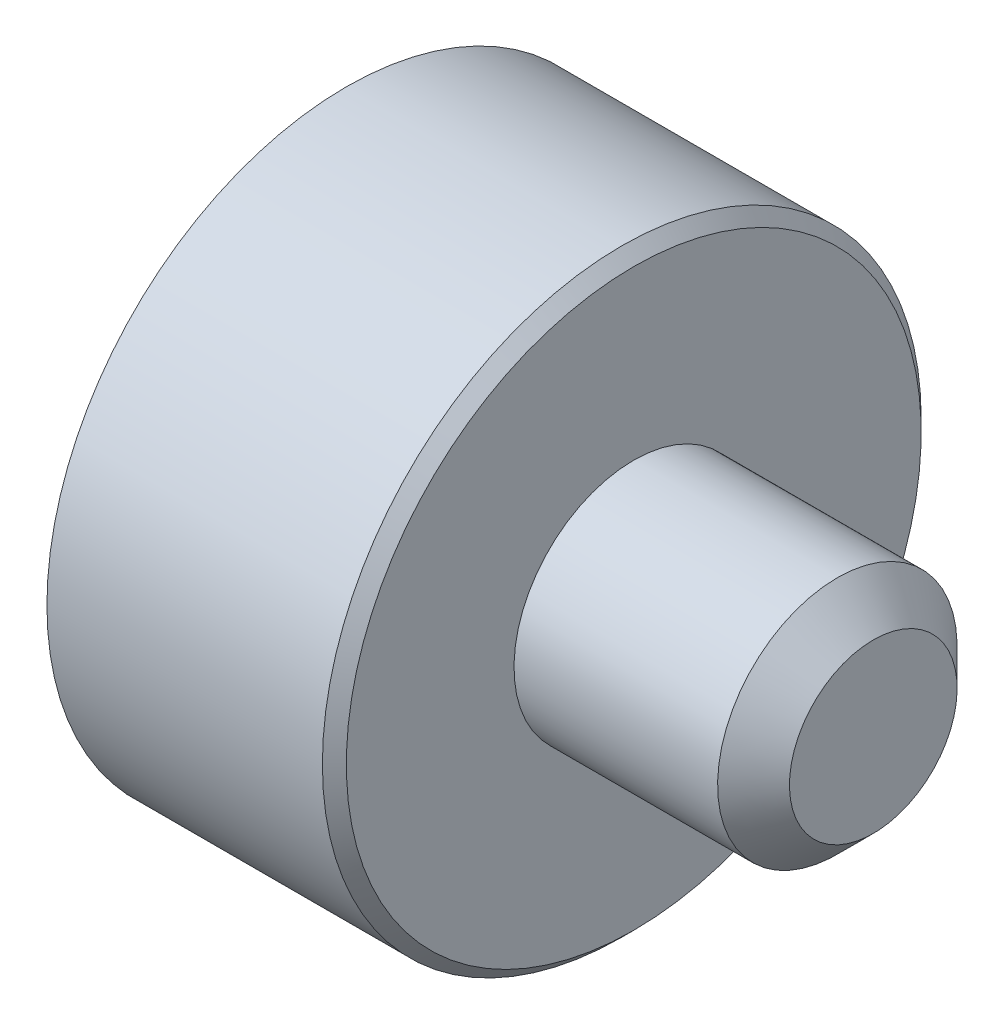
ISO-10303-21;
HEADER;
FILE_DESCRIPTION(('STEP AP214'),'2;1');
FILE_NAME('part.step','',(''),(''),'','','');
FILE_SCHEMA(('AUTOMOTIVE_DESIGN { 1 0 10303 214 1 1 1 1 }'));
ENDSEC;
DATA;
#1=APPLICATION_CONTEXT('core data for automotive mechanical design processes');
#2=APPLICATION_PROTOCOL_DEFINITION('international standard','automotive_design',2000,#1);
#3=PRODUCT_CONTEXT('',#1,'mechanical');
#4=PRODUCT('Part','Part','',(#3));
#5=PRODUCT_RELATED_PRODUCT_CATEGORY('part','',(#4));
#6=PRODUCT_DEFINITION_FORMATION('','',#4);
#7=PRODUCT_DEFINITION_CONTEXT('part definition',#1,'design');
#8=PRODUCT_DEFINITION('design','',#6,#7);
#9=PRODUCT_DEFINITION_SHAPE('','',#8);
#10=(LENGTH_UNIT() NAMED_UNIT(*) SI_UNIT(.MILLI.,.METRE.));
#11=(NAMED_UNIT(*) PLANE_ANGLE_UNIT() SI_UNIT($,.RADIAN.));
#12=(NAMED_UNIT(*) SI_UNIT($,.STERADIAN.) SOLID_ANGLE_UNIT());
#13=UNCERTAINTY_MEASURE_WITH_UNIT(LENGTH_MEASURE(1.E-05),#10,'distance_accuracy_value','');
#14=(GEOMETRIC_REPRESENTATION_CONTEXT(3) GLOBAL_UNCERTAINTY_ASSIGNED_CONTEXT((#13)) GLOBAL_UNIT_ASSIGNED_CONTEXT((#10,
#11,#12)) REPRESENTATION_CONTEXT('',''));
#15=CARTESIAN_POINT('',(0.,0.,0.));
#16=DIRECTION('',(0.,0.,1.));
#17=DIRECTION('',(1.,0.,0.));
#18=AXIS2_PLACEMENT_3D('',#15,#16,#17);
#19=CARTESIAN_POINT('',(0.,0.,0.));
#20=DIRECTION('',(-1.,0.,0.));
#21=DIRECTION('',(0.,-1.,0.));
#22=AXIS2_PLACEMENT_3D('',#19,#20,#21);
#23=PLANE('',#22);
#24=CARTESIAN_POINT('',(0.,0.,0.));
#25=DIRECTION('',(1.,0.,0.));
#26=DIRECTION('',(0.,1.,0.));
#27=AXIS2_PLACEMENT_3D('',#24,#25,#26);
#28=CIRCLE('',#27,5.);
#29=CARTESIAN_POINT('',(0.,5.,0.));
#30=VERTEX_POINT('',#29);
#31=EDGE_CURVE('E10',#30,#30,#28,.T.);
#32=ORIENTED_EDGE('',*,*,#31,.F.);
#33=EDGE_LOOP('',(#32));
#34=FACE_BOUND('',#33,.T.);
#35=ADVANCED_FACE('F29',(#34),#23,.T.);
#36=CARTESIAN_POINT('',(27.,0.,0.));
#37=DIRECTION('',(1.,0.,0.));
#38=DIRECTION('',(0.,1.,0.));
#39=AXIS2_PLACEMENT_3D('',#36,#37,#38);
#40=CYLINDRICAL_SURFACE('',#39,5.);
#41=ORIENTED_EDGE('',*,*,#31,.T.);
#42=EDGE_LOOP('',(#41));
#43=FACE_BOUND('',#42,.T.);
#44=CARTESIAN_POINT('',(5.,0.,0.));
#45=DIRECTION('',(1.,0.,0.));
#46=DIRECTION('',(0.,1.,0.));
#47=AXIS2_PLACEMENT_3D('',#44,#45,#46);
#48=CIRCLE('',#47,5.);
#49=CARTESIAN_POINT('',(5.,5.,0.));
#50=VERTEX_POINT('',#49);
#51=EDGE_CURVE('E35',#50,#50,#48,.T.);
#52=ORIENTED_EDGE('',*,*,#51,.F.);
#53=EDGE_LOOP('',(#52));
#54=FACE_BOUND('',#53,.T.);
#55=ADVANCED_FACE('F77',(#43,#54),#40,.T.);
#56=CARTESIAN_POINT('',(5.,5.,0.));
#57=DIRECTION('',(-1.,0.,0.));
#58=DIRECTION('',(0.,-1.,0.));
#59=AXIS2_PLACEMENT_3D('',#56,#57,#58);
#60=PLANE('',#59);
#61=ORIENTED_EDGE('',*,*,#51,.T.);
#62=EDGE_LOOP('',(#61));
#63=FACE_BOUND('',#62,.T.);
#64=CARTESIAN_POINT('',(5.,0.,0.));
#65=DIRECTION('',(1.,0.,0.));
#66=DIRECTION('',(0.,1.,0.));
#67=AXIS2_PLACEMENT_3D('',#64,#65,#66);
#68=CIRCLE('',#67,12.5);
#69=CARTESIAN_POINT('',(5.,12.5,0.));
#70=VERTEX_POINT('',#69);
#71=EDGE_CURVE('E39',#70,#70,#68,.T.);
#72=ORIENTED_EDGE('',*,*,#71,.F.);
#73=EDGE_LOOP('',(#72));
#74=FACE_BOUND('',#73,.T.);
#75=ADVANCED_FACE('F82',(#63,#74),#60,.T.);
#76=CARTESIAN_POINT('',(27.,0.,0.));
#77=DIRECTION('',(1.,0.,0.));
#78=DIRECTION('',(0.,1.,0.));
#79=AXIS2_PLACEMENT_3D('',#76,#77,#78);
#80=CYLINDRICAL_SURFACE('',#79,12.5);
#81=ORIENTED_EDGE('',*,*,#71,.T.);
#82=EDGE_LOOP('',(#81));
#83=FACE_BOUND('',#82,.T.);
#84=CARTESIAN_POINT('',(16.5,0.,0.));
#85=DIRECTION('',(1.,0.,0.));
#86=DIRECTION('',(0.,1.,0.));
#87=AXIS2_PLACEMENT_3D('',#84,#85,#86);
#88=CIRCLE('',#87,12.5);
#89=CARTESIAN_POINT('',(16.5,12.5,0.));
#90=VERTEX_POINT('',#89);
#91=EDGE_CURVE('E43',#90,#90,#88,.T.);
#92=ORIENTED_EDGE('',*,*,#91,.F.);
#93=EDGE_LOOP('',(#92));
#94=FACE_BOUND('',#93,.T.);
#95=ADVANCED_FACE('F86',(#83,#94),#80,.T.);
#96=CARTESIAN_POINT('',(17.,0.,0.));
#97=DIRECTION('',(-1.,0.,0.));
#98=DIRECTION('',(0.,-1.,0.));
#99=AXIS2_PLACEMENT_3D('',#96,#97,#98);
#100=CONICAL_SURFACE('',#99,12.,0.785398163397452);
#101=ORIENTED_EDGE('',*,*,#91,.T.);
#102=EDGE_LOOP('',(#101));
#103=FACE_BOUND('',#102,.T.);
#104=CARTESIAN_POINT('',(17.,0.,0.));
#105=DIRECTION('',(1.,0.,0.));
#106=DIRECTION('',(0.,1.,0.));
#107=AXIS2_PLACEMENT_3D('',#104,#105,#106);
#108=CIRCLE('',#107,12.);
#109=CARTESIAN_POINT('',(17.,12.,0.));
#110=VERTEX_POINT('',#109);
#111=EDGE_CURVE('E48',#110,#110,#108,.T.);
#112=ORIENTED_EDGE('',*,*,#111,.F.);
#113=EDGE_LOOP('',(#112));
#114=FACE_BOUND('',#113,.T.);
#115=ADVANCED_FACE('F92',(#103,#114),#100,.T.);
#116=CARTESIAN_POINT('',(17.,12.,0.));
#117=DIRECTION('',(1.,0.,0.));
#118=DIRECTION('',(0.,1.,0.));
#119=AXIS2_PLACEMENT_3D('',#116,#117,#118);
#120=PLANE('',#119);
#121=ORIENTED_EDGE('',*,*,#111,.T.);
#122=EDGE_LOOP('',(#121));
#123=FACE_BOUND('',#122,.T.);
#124=CARTESIAN_POINT('',(17.,0.,0.));
#125=DIRECTION('',(1.,0.,0.));
#126=DIRECTION('',(0.,1.,0.));
#127=AXIS2_PLACEMENT_3D('',#124,#125,#126);
#128=CIRCLE('',#127,5.);
#129=CARTESIAN_POINT('',(17.,5.,0.));
#130=VERTEX_POINT('',#129);
#131=EDGE_CURVE('E51',#130,#130,#128,.T.);
#132=ORIENTED_EDGE('',*,*,#131,.F.);
#133=EDGE_LOOP('',(#132));
#134=FACE_BOUND('',#133,.T.);
#135=ADVANCED_FACE('F73',(#123,#134),#120,.T.);
#136=CARTESIAN_POINT('',(27.,0.,0.));
#137=DIRECTION('',(1.,0.,0.));
#138=DIRECTION('',(0.,1.,0.));
#139=AXIS2_PLACEMENT_3D('',#136,#137,#138);
#140=CYLINDRICAL_SURFACE('',#139,5.);
#141=ORIENTED_EDGE('',*,*,#131,.T.);
#142=EDGE_LOOP('',(#141));
#143=FACE_BOUND('',#142,.T.);
#144=CARTESIAN_POINT('',(25.5,0.,0.));
#145=DIRECTION('',(1.,0.,0.));
#146=DIRECTION('',(0.,1.,0.));
#147=AXIS2_PLACEMENT_3D('',#144,#145,#146);
#148=CIRCLE('',#147,5.);
#149=CARTESIAN_POINT('',(25.5,5.,0.));
#150=VERTEX_POINT('',#149);
#151=EDGE_CURVE('E54',#150,#150,#148,.T.);
#152=ORIENTED_EDGE('',*,*,#151,.F.);
#153=EDGE_LOOP('',(#152));
#154=FACE_BOUND('',#153,.T.);
#155=ADVANCED_FACE('F65',(#143,#154),#140,.T.);
#156=CARTESIAN_POINT('',(27.,0.,0.));
#157=DIRECTION('',(-1.,0.,0.));
#158=DIRECTION('',(0.,-1.,0.));
#159=AXIS2_PLACEMENT_3D('',#156,#157,#158);
#160=CONICAL_SURFACE('',#159,3.49999999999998,0.785398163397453);
#161=ORIENTED_EDGE('',*,*,#151,.T.);
#162=EDGE_LOOP('',(#161));
#163=FACE_BOUND('',#162,.T.);
#164=CARTESIAN_POINT('',(27.,0.,0.));
#165=DIRECTION('',(1.,0.,0.));
#166=DIRECTION('',(0.,1.,0.));
#167=AXIS2_PLACEMENT_3D('',#164,#165,#166);
#168=CIRCLE('',#167,3.49999999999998);
#169=CARTESIAN_POINT('',(27.,3.49999999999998,0.));
#170=VERTEX_POINT('',#169);
#171=EDGE_CURVE('E57',#170,#170,#168,.T.);
#172=ORIENTED_EDGE('',*,*,#171,.F.);
#173=EDGE_LOOP('',(#172));
#174=FACE_BOUND('',#173,.T.);
#175=ADVANCED_FACE('F63',(#163,#174),#160,.T.);
#176=CARTESIAN_POINT('',(27.,3.49999999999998,0.));
#177=DIRECTION('',(1.,0.,0.));
#178=DIRECTION('',(0.,1.,0.));
#179=AXIS2_PLACEMENT_3D('',#176,#177,#178);
#180=PLANE('',#179);
#181=ORIENTED_EDGE('',*,*,#171,.T.);
#182=EDGE_LOOP('',(#181));
#183=FACE_BOUND('',#182,.T.);
#184=ADVANCED_FACE('F61',(#183),#180,.T.);
#185=CLOSED_SHELL('',(#35,#55,#75,#95,#115,#135,#155,#175,#184));
#186=MANIFOLD_SOLID_BREP('B2',#185);
#187=ADVANCED_BREP_SHAPE_REPRESENTATION('',(#18,#186),#14);
#188=SHAPE_DEFINITION_REPRESENTATION(#9,#187);
ENDSEC;
END-ISO-10303-21;
